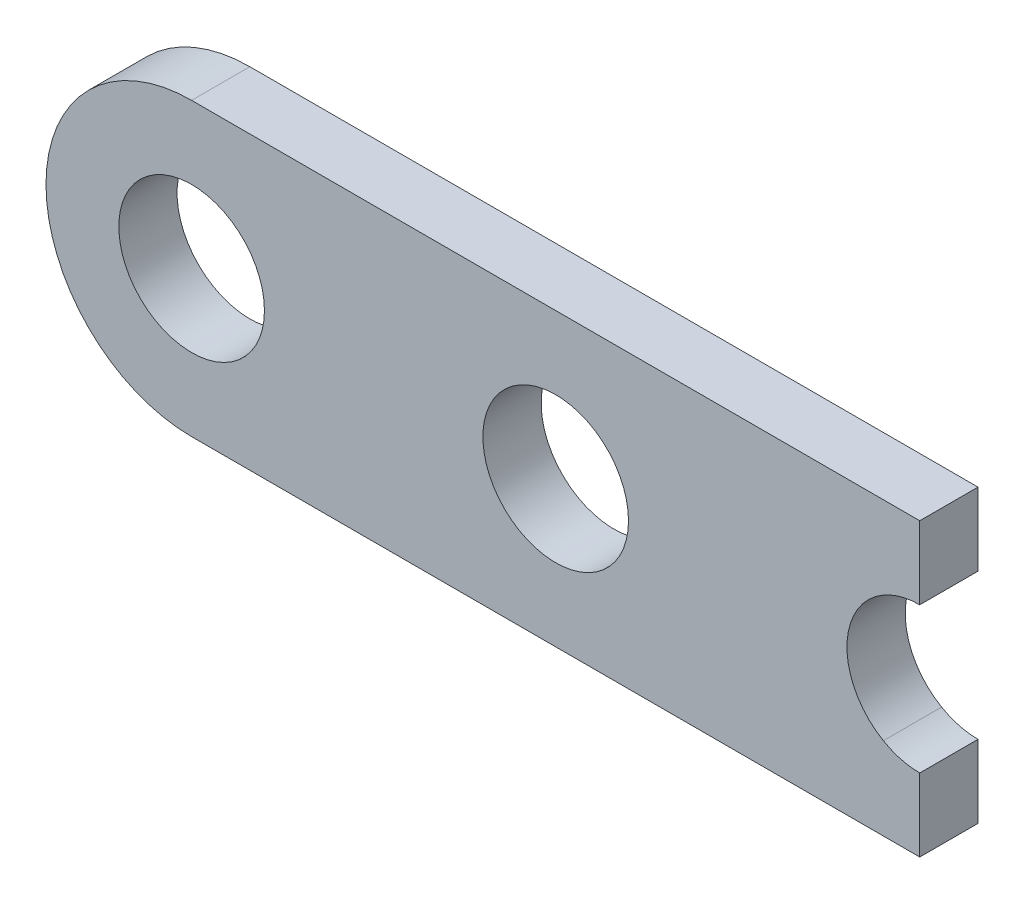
ISO-10303-21;
HEADER;
FILE_DESCRIPTION(('STEP AP214'),'2;1');
FILE_NAME('part.step','',(''),(''),'','','');
FILE_SCHEMA(('AUTOMOTIVE_DESIGN { 1 0 10303 214 1 1 1 1 }'));
ENDSEC;
DATA;
#1=APPLICATION_CONTEXT('core data for automotive mechanical design processes');
#2=APPLICATION_PROTOCOL_DEFINITION('international standard','automotive_design',2000,#1);
#3=PRODUCT_CONTEXT('',#1,'mechanical');
#4=PRODUCT('Part','Part','',(#3));
#5=PRODUCT_RELATED_PRODUCT_CATEGORY('part','',(#4));
#6=PRODUCT_DEFINITION_FORMATION('','',#4);
#7=PRODUCT_DEFINITION_CONTEXT('part definition',#1,'design');
#8=PRODUCT_DEFINITION('design','',#6,#7);
#9=PRODUCT_DEFINITION_SHAPE('','',#8);
#10=(LENGTH_UNIT() NAMED_UNIT(*) SI_UNIT(.MILLI.,.METRE.));
#11=(NAMED_UNIT(*) PLANE_ANGLE_UNIT() SI_UNIT($,.RADIAN.));
#12=(NAMED_UNIT(*) SI_UNIT($,.STERADIAN.) SOLID_ANGLE_UNIT());
#13=UNCERTAINTY_MEASURE_WITH_UNIT(LENGTH_MEASURE(1.E-05),#10,'distance_accuracy_value','');
#14=(GEOMETRIC_REPRESENTATION_CONTEXT(3) GLOBAL_UNCERTAINTY_ASSIGNED_CONTEXT((#13)) GLOBAL_UNIT_ASSIGNED_CONTEXT((#10,
#11,#12)) REPRESENTATION_CONTEXT('',''));
#15=CARTESIAN_POINT('',(0.,0.,0.));
#16=DIRECTION('',(0.,0.,1.));
#17=DIRECTION('',(1.,0.,0.));
#18=AXIS2_PLACEMENT_3D('',#15,#16,#17);
#19=CARTESIAN_POINT('',(250.,50.,0.));
#20=DIRECTION('',(0.,0.,1.));
#21=DIRECTION('',(1.,0.,0.));
#22=AXIS2_PLACEMENT_3D('',#19,#20,#21);
#23=CYLINDRICAL_SURFACE('',#22,25.);
#24=DIRECTION('',(0.,0.,1.));
#25=VECTOR('',#24,1.);
#26=CARTESIAN_POINT('',(250.,25.,0.));
#27=LINE('',#26,#25);
#28=CARTESIAN_POINT('',(250.,25.,0.));
#29=VERTEX_POINT('',#28);
#30=CARTESIAN_POINT('',(250.,25.,20.));
#31=VERTEX_POINT('',#30);
#32=EDGE_CURVE('E125',#29,#31,#27,.T.);
#33=ORIENTED_EDGE('',*,*,#32,.F.);
#34=CARTESIAN_POINT('',(250.,50.,0.));
#35=DIRECTION('',(0.,0.,1.));
#36=DIRECTION('',(1.,0.,0.));
#37=AXIS2_PLACEMENT_3D('',#34,#35,#36);
#38=CIRCLE('',#37,25.);
#39=CARTESIAN_POINT('',(237.5,28.349364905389,0.));
#40=VERTEX_POINT('',#39);
#41=EDGE_CURVE('E108',#40,#29,#38,.T.);
#42=ORIENTED_EDGE('',*,*,#41,.F.);
#43=DIRECTION('',(0.,0.,1.));
#44=VECTOR('',#43,1.);
#45=CARTESIAN_POINT('',(237.5,28.349364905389,0.));
#46=LINE('',#45,#44);
#47=CARTESIAN_POINT('',(237.5,28.349364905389,20.));
#48=VERTEX_POINT('',#47);
#49=EDGE_CURVE('E169',#40,#48,#46,.T.);
#50=ORIENTED_EDGE('',*,*,#49,.T.);
#51=CARTESIAN_POINT('',(250.,50.,20.));
#52=DIRECTION('',(0.,0.,1.));
#53=DIRECTION('',(1.,0.,0.));
#54=AXIS2_PLACEMENT_3D('',#51,#52,#53);
#55=CIRCLE('',#54,25.);
#56=EDGE_CURVE('E124',#48,#31,#55,.T.);
#57=ORIENTED_EDGE('',*,*,#56,.T.);
#58=EDGE_LOOP('',(#33,#42,#50,#57));
#59=FACE_BOUND('',#58,.T.);
#60=ADVANCED_FACE('F32',(#59),#23,.F.);
#61=CARTESIAN_POINT('',(0.,0.,20.));
#62=DIRECTION('',(0.,1.,0.));
#63=DIRECTION('',(0.,0.,1.));
#64=AXIS2_PLACEMENT_3D('',#61,#62,#63);
#65=PLANE('',#64);
#66=DIRECTION('',(0.,0.,-1.));
#67=VECTOR('',#66,1.);
#68=CARTESIAN_POINT('',(250.,0.,20.));
#69=LINE('',#68,#67);
#70=CARTESIAN_POINT('',(250.,0.,20.));
#71=VERTEX_POINT('',#70);
#72=CARTESIAN_POINT('',(250.,0.,0.));
#73=VERTEX_POINT('',#72);
#74=EDGE_CURVE('E55',#71,#73,#69,.T.);
#75=ORIENTED_EDGE('',*,*,#74,.F.);
#76=DIRECTION('',(1.,0.,0.));
#77=VECTOR('',#76,1.);
#78=CARTESIAN_POINT('',(0.,0.,20.));
#79=LINE('',#78,#77);
#80=CARTESIAN_POINT('',(0.,0.,20.));
#81=VERTEX_POINT('',#80);
#82=EDGE_CURVE('E159',#81,#71,#79,.T.);
#83=ORIENTED_EDGE('',*,*,#82,.F.);
#84=DIRECTION('',(0.,0.,-1.));
#85=VECTOR('',#84,1.);
#86=CARTESIAN_POINT('',(0.,0.,20.));
#87=LINE('',#86,#85);
#88=CARTESIAN_POINT('',(0.,0.,0.));
#89=VERTEX_POINT('',#88);
#90=EDGE_CURVE('E166',#81,#89,#87,.T.);
#91=ORIENTED_EDGE('',*,*,#90,.T.);
#92=DIRECTION('',(1.,0.,0.));
#93=VECTOR('',#92,1.);
#94=CARTESIAN_POINT('',(0.,0.,0.));
#95=LINE('',#94,#93);
#96=EDGE_CURVE('E153',#89,#73,#95,.T.);
#97=ORIENTED_EDGE('',*,*,#96,.T.);
#98=EDGE_LOOP('',(#75,#83,#91,#97));
#99=FACE_BOUND('',#98,.T.);
#100=ADVANCED_FACE('F192',(#99),#65,.F.);
#101=CARTESIAN_POINT('',(0.,100.,20.));
#102=DIRECTION('',(0.,-1.,0.));
#103=DIRECTION('',(0.,0.,-1.));
#104=AXIS2_PLACEMENT_3D('',#101,#102,#103);
#105=PLANE('',#104);
#106=DIRECTION('',(0.,0.,1.));
#107=VECTOR('',#106,1.);
#108=CARTESIAN_POINT('',(250.,100.,20.));
#109=LINE('',#108,#107);
#110=CARTESIAN_POINT('',(250.,100.,0.));
#111=VERTEX_POINT('',#110);
#112=CARTESIAN_POINT('',(250.,100.,20.));
#113=VERTEX_POINT('',#112);
#114=EDGE_CURVE('E120',#111,#113,#109,.T.);
#115=ORIENTED_EDGE('',*,*,#114,.F.);
#116=DIRECTION('',(-1.,0.,0.));
#117=VECTOR('',#116,1.);
#118=CARTESIAN_POINT('',(0.,100.,0.));
#119=LINE('',#118,#117);
#120=CARTESIAN_POINT('',(0.,100.,0.));
#121=VERTEX_POINT('',#120);
#122=EDGE_CURVE('E114',#111,#121,#119,.T.);
#123=ORIENTED_EDGE('',*,*,#122,.T.);
#124=DIRECTION('',(0.,0.,-1.));
#125=VECTOR('',#124,1.);
#126=CARTESIAN_POINT('',(0.,100.,20.));
#127=LINE('',#126,#125);
#128=CARTESIAN_POINT('',(0.,100.,20.));
#129=VERTEX_POINT('',#128);
#130=EDGE_CURVE('E163',#129,#121,#127,.T.);
#131=ORIENTED_EDGE('',*,*,#130,.F.);
#132=DIRECTION('',(-1.,0.,0.));
#133=VECTOR('',#132,1.);
#134=CARTESIAN_POINT('',(0.,100.,20.));
#135=LINE('',#134,#133);
#136=EDGE_CURVE('E161',#113,#129,#135,.T.);
#137=ORIENTED_EDGE('',*,*,#136,.F.);
#138=EDGE_LOOP('',(#115,#123,#131,#137));
#139=FACE_BOUND('',#138,.T.);
#140=ADVANCED_FACE('F197',(#139),#105,.F.);
#141=CARTESIAN_POINT('',(0.,50.,20.));
#142=DIRECTION('',(0.,0.,1.));
#143=DIRECTION('',(1.,0.,0.));
#144=AXIS2_PLACEMENT_3D('',#141,#142,#143);
#145=PLANE('',#144);
#146=CARTESIAN_POINT('',(0.,50.,20.));
#147=DIRECTION('',(0.,0.,1.));
#148=DIRECTION('',(1.,0.,0.));
#149=AXIS2_PLACEMENT_3D('',#146,#147,#148);
#150=CIRCLE('',#149,25.);
#151=CARTESIAN_POINT('',(25.,50.,20.));
#152=VERTEX_POINT('',#151);
#153=EDGE_CURVE('E144',#152,#152,#150,.T.);
#154=ORIENTED_EDGE('',*,*,#153,.F.);
#155=EDGE_LOOP('',(#154));
#156=FACE_BOUND('',#155,.T.);
#157=CARTESIAN_POINT('',(125.,50.,20.));
#158=DIRECTION('',(0.,0.,1.));
#159=DIRECTION('',(1.,0.,0.));
#160=AXIS2_PLACEMENT_3D('',#157,#158,#159);
#161=CIRCLE('',#160,25.);
#162=CARTESIAN_POINT('',(150.,50.,20.));
#163=VERTEX_POINT('',#162);
#164=EDGE_CURVE('E105',#163,#163,#161,.T.);
#165=ORIENTED_EDGE('',*,*,#164,.F.);
#166=EDGE_LOOP('',(#165));
#167=FACE_BOUND('',#166,.T.);
#168=ORIENTED_EDGE('',*,*,#82,.T.);
#169=DIRECTION('',(0.,1.,0.));
#170=VECTOR('',#169,1.);
#171=CARTESIAN_POINT('',(250.,50.,20.));
#172=LINE('',#171,#170);
#173=EDGE_CURVE('E122',#71,#31,#172,.T.);
#174=ORIENTED_EDGE('',*,*,#173,.T.);
#175=ORIENTED_EDGE('',*,*,#56,.F.);
#176=CARTESIAN_POINT('',(237.5,71.650635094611,20.));
#177=VERTEX_POINT('',#176);
#178=EDGE_CURVE('E129',#177,#48,#55,.T.);
#179=ORIENTED_EDGE('',*,*,#178,.F.);
#180=CARTESIAN_POINT('',(250.,75.,20.));
#181=VERTEX_POINT('',#180);
#182=EDGE_CURVE('E131',#181,#177,#55,.T.);
#183=ORIENTED_EDGE('',*,*,#182,.F.);
#184=EDGE_CURVE('E47',#181,#113,#172,.T.);
#185=ORIENTED_EDGE('',*,*,#184,.T.);
#186=ORIENTED_EDGE('',*,*,#136,.T.);
#187=CARTESIAN_POINT('',(0.,50.,20.));
#188=DIRECTION('',(0.,0.,1.));
#189=DIRECTION('',(1.,0.,0.));
#190=AXIS2_PLACEMENT_3D('',#187,#188,#189);
#191=CIRCLE('',#190,50.);
#192=EDGE_CURVE('E156',#129,#81,#191,.T.);
#193=ORIENTED_EDGE('',*,*,#192,.T.);
#194=EDGE_LOOP('',(#168,#174,#175,#179,#183,#185,#186,#193));
#195=FACE_BOUND('',#194,.T.);
#196=ADVANCED_FACE('F181',(#156,#167,#195),#145,.T.);
#197=CARTESIAN_POINT('',(0.,50.,0.));
#198=DIRECTION('',(0.,0.,1.));
#199=DIRECTION('',(1.,0.,0.));
#200=AXIS2_PLACEMENT_3D('',#197,#198,#199);
#201=PLANE('',#200);
#202=CARTESIAN_POINT('',(0.,50.,0.));
#203=DIRECTION('',(0.,0.,1.));
#204=DIRECTION('',(1.,0.,0.));
#205=AXIS2_PLACEMENT_3D('',#202,#203,#204);
#206=CIRCLE('',#205,25.);
#207=CARTESIAN_POINT('',(25.,50.,0.));
#208=VERTEX_POINT('',#207);
#209=EDGE_CURVE('E147',#208,#208,#206,.T.);
#210=ORIENTED_EDGE('',*,*,#209,.T.);
#211=EDGE_LOOP('',(#210));
#212=FACE_BOUND('',#211,.T.);
#213=CARTESIAN_POINT('',(125.,50.,0.));
#214=DIRECTION('',(0.,0.,1.));
#215=DIRECTION('',(1.,0.,0.));
#216=AXIS2_PLACEMENT_3D('',#213,#214,#215);
#217=CIRCLE('',#216,25.);
#218=CARTESIAN_POINT('',(150.,50.,0.));
#219=VERTEX_POINT('',#218);
#220=EDGE_CURVE('E141',#219,#219,#217,.T.);
#221=ORIENTED_EDGE('',*,*,#220,.T.);
#222=EDGE_LOOP('',(#221));
#223=FACE_BOUND('',#222,.T.);
#224=DIRECTION('',(0.,1.,0.));
#225=VECTOR('',#224,1.);
#226=CARTESIAN_POINT('',(250.,50.,0.));
#227=LINE('',#226,#225);
#228=EDGE_CURVE('E118',#73,#29,#227,.T.);
#229=ORIENTED_EDGE('',*,*,#228,.F.);
#230=ORIENTED_EDGE('',*,*,#96,.F.);
#231=CARTESIAN_POINT('',(0.,50.,0.));
#232=DIRECTION('',(0.,0.,1.));
#233=DIRECTION('',(1.,0.,0.));
#234=AXIS2_PLACEMENT_3D('',#231,#232,#233);
#235=CIRCLE('',#234,50.);
#236=EDGE_CURVE('E150',#121,#89,#235,.T.);
#237=ORIENTED_EDGE('',*,*,#236,.F.);
#238=ORIENTED_EDGE('',*,*,#122,.F.);
#239=CARTESIAN_POINT('',(250.,75.,0.));
#240=VERTEX_POINT('',#239);
#241=EDGE_CURVE('E111',#240,#111,#227,.T.);
#242=ORIENTED_EDGE('',*,*,#241,.F.);
#243=CARTESIAN_POINT('',(237.5,71.650635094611,0.));
#244=VERTEX_POINT('',#243);
#245=EDGE_CURVE('E98',#240,#244,#38,.T.);
#246=ORIENTED_EDGE('',*,*,#245,.T.);
#247=EDGE_CURVE('E106',#244,#40,#38,.T.);
#248=ORIENTED_EDGE('',*,*,#247,.T.);
#249=ORIENTED_EDGE('',*,*,#41,.T.);
#250=EDGE_LOOP('',(#229,#230,#237,#238,#242,#246,#248,#249));
#251=FACE_BOUND('',#250,.T.);
#252=ADVANCED_FACE('F112',(#212,#223,#251),#201,.F.);
#253=DIRECTION('',(0.,0.,1.));
#254=VECTOR('',#253,1.);
#255=CARTESIAN_POINT('',(250.,75.,0.));
#256=LINE('',#255,#254);
#257=EDGE_CURVE('E11',#181,#240,#256,.F.);
#258=ORIENTED_EDGE('',*,*,#257,.F.);
#259=ORIENTED_EDGE('',*,*,#182,.T.);
#260=DIRECTION('',(0.,0.,1.));
#261=VECTOR('',#260,1.);
#262=CARTESIAN_POINT('',(237.5,71.650635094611,0.));
#263=LINE('',#262,#261);
#264=EDGE_CURVE('E40',#177,#244,#263,.F.);
#265=ORIENTED_EDGE('',*,*,#264,.T.);
#266=ORIENTED_EDGE('',*,*,#245,.F.);
#267=EDGE_LOOP('',(#258,#259,#265,#266));
#268=FACE_BOUND('',#267,.T.);
#269=ADVANCED_FACE('F100',(#268),#23,.F.);
#270=ORIENTED_EDGE('',*,*,#264,.F.);
#271=ORIENTED_EDGE('',*,*,#178,.T.);
#272=ORIENTED_EDGE('',*,*,#49,.F.);
#273=ORIENTED_EDGE('',*,*,#247,.F.);
#274=EDGE_LOOP('',(#270,#271,#272,#273));
#275=FACE_BOUND('',#274,.T.);
#276=ADVANCED_FACE('F182',(#275),#23,.F.);
#277=CARTESIAN_POINT('',(0.,50.,20.));
#278=DIRECTION('',(0.,0.,-1.));
#279=DIRECTION('',(-1.,0.,0.));
#280=AXIS2_PLACEMENT_3D('',#277,#278,#279);
#281=CYLINDRICAL_SURFACE('',#280,50.);
#282=ORIENTED_EDGE('',*,*,#236,.T.);
#283=ORIENTED_EDGE('',*,*,#90,.F.);
#284=ORIENTED_EDGE('',*,*,#192,.F.);
#285=ORIENTED_EDGE('',*,*,#130,.T.);
#286=EDGE_LOOP('',(#282,#283,#284,#285));
#287=FACE_BOUND('',#286,.T.);
#288=ADVANCED_FACE('F34',(#287),#281,.T.);
#289=CARTESIAN_POINT('',(0.,50.,0.));
#290=DIRECTION('',(0.,0.,1.));
#291=DIRECTION('',(1.,0.,0.));
#292=AXIS2_PLACEMENT_3D('',#289,#290,#291);
#293=CYLINDRICAL_SURFACE('',#292,25.);
#294=ORIENTED_EDGE('',*,*,#209,.F.);
#295=EDGE_LOOP('',(#294));
#296=FACE_BOUND('',#295,.T.);
#297=ORIENTED_EDGE('',*,*,#153,.T.);
#298=EDGE_LOOP('',(#297));
#299=FACE_BOUND('',#298,.T.);
#300=ADVANCED_FACE('F204',(#296,#299),#293,.F.);
#301=CARTESIAN_POINT('',(125.,50.,0.));
#302=DIRECTION('',(0.,0.,1.));
#303=DIRECTION('',(1.,0.,0.));
#304=AXIS2_PLACEMENT_3D('',#301,#302,#303);
#305=CYLINDRICAL_SURFACE('',#304,25.);
#306=ORIENTED_EDGE('',*,*,#220,.F.);
#307=EDGE_LOOP('',(#306));
#308=FACE_BOUND('',#307,.T.);
#309=ORIENTED_EDGE('',*,*,#164,.T.);
#310=EDGE_LOOP('',(#309));
#311=FACE_BOUND('',#310,.T.);
#312=ADVANCED_FACE('F189',(#308,#311),#305,.F.);
#313=CARTESIAN_POINT('',(250.,189.451192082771,780.756202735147));
#314=DIRECTION('',(1.,0.,0.));
#315=DIRECTION('',(0.,1.,0.));
#316=AXIS2_PLACEMENT_3D('',#313,#314,#315);
#317=PLANE('',#316);
#318=ORIENTED_EDGE('',*,*,#241,.T.);
#319=ORIENTED_EDGE('',*,*,#114,.T.);
#320=ORIENTED_EDGE('',*,*,#184,.F.);
#321=ORIENTED_EDGE('',*,*,#257,.T.);
#322=EDGE_LOOP('',(#318,#319,#320,#321));
#323=FACE_BOUND('',#322,.T.);
#324=ADVANCED_FACE('F119',(#323),#317,.T.);
#325=ORIENTED_EDGE('',*,*,#173,.F.);
#326=ORIENTED_EDGE('',*,*,#74,.T.);
#327=ORIENTED_EDGE('',*,*,#228,.T.);
#328=ORIENTED_EDGE('',*,*,#32,.T.);
#329=EDGE_LOOP('',(#325,#326,#327,#328));
#330=FACE_BOUND('',#329,.T.);
#331=ADVANCED_FACE('F183',(#330),#317,.T.);
#332=CLOSED_SHELL('',(#60,#100,#140,#196,#252,#269,#276,#288,#300,#312,#324,#331));
#333=MANIFOLD_SOLID_BREP('B2',#332);
#334=ADVANCED_BREP_SHAPE_REPRESENTATION('',(#18,#333),#14);
#335=SHAPE_DEFINITION_REPRESENTATION(#9,#334);
ENDSEC;
END-ISO-10303-21;
